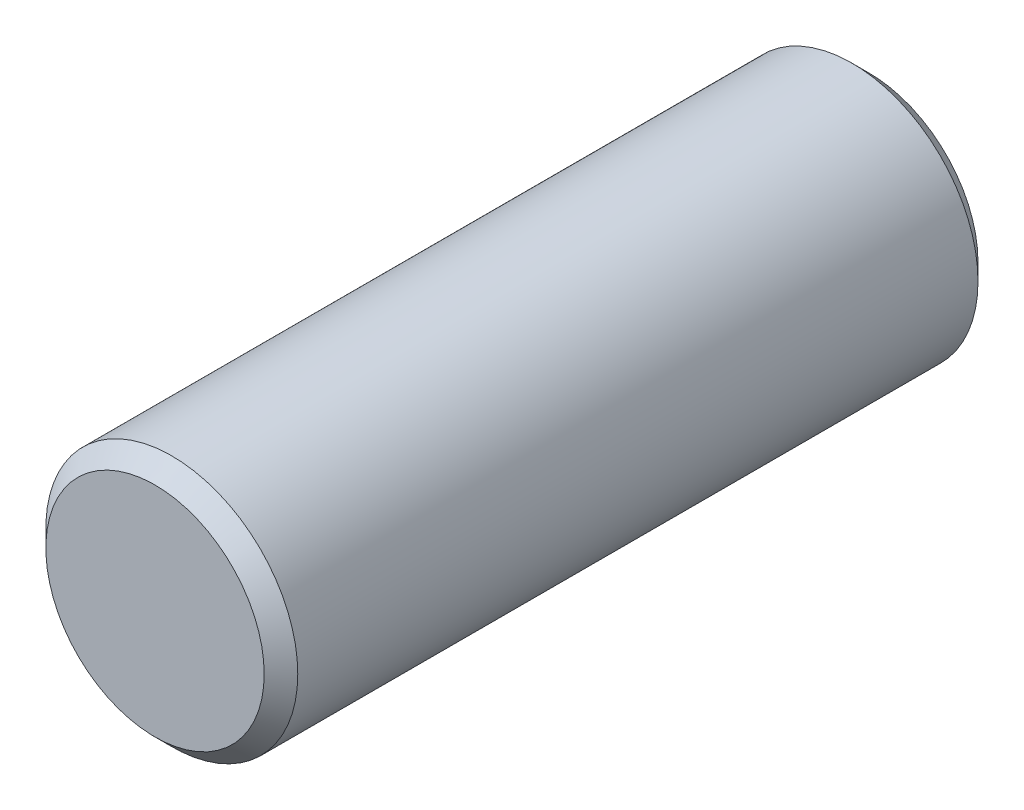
ISO-10303-21;
HEADER;
FILE_DESCRIPTION(('STEP AP214'),'2;1');
FILE_NAME('part.step','',(''),(''),'','','');
FILE_SCHEMA(('AUTOMOTIVE_DESIGN { 1 0 10303 214 1 1 1 1 }'));
ENDSEC;
DATA;
#1=APPLICATION_CONTEXT('core data for automotive mechanical design processes');
#2=APPLICATION_PROTOCOL_DEFINITION('international standard','automotive_design',2000,#1);
#3=PRODUCT_CONTEXT('',#1,'mechanical');
#4=PRODUCT('Part','Part','',(#3));
#5=PRODUCT_RELATED_PRODUCT_CATEGORY('part','',(#4));
#6=PRODUCT_DEFINITION_FORMATION('','',#4);
#7=PRODUCT_DEFINITION_CONTEXT('part definition',#1,'design');
#8=PRODUCT_DEFINITION('design','',#6,#7);
#9=PRODUCT_DEFINITION_SHAPE('','',#8);
#10=(LENGTH_UNIT() NAMED_UNIT(*) SI_UNIT(.MILLI.,.METRE.));
#11=(NAMED_UNIT(*) PLANE_ANGLE_UNIT() SI_UNIT($,.RADIAN.));
#12=(NAMED_UNIT(*) SI_UNIT($,.STERADIAN.) SOLID_ANGLE_UNIT());
#13=UNCERTAINTY_MEASURE_WITH_UNIT(LENGTH_MEASURE(1.E-05),#10,'distance_accuracy_value','');
#14=(GEOMETRIC_REPRESENTATION_CONTEXT(3) GLOBAL_UNCERTAINTY_ASSIGNED_CONTEXT((#13)) GLOBAL_UNIT_ASSIGNED_CONTEXT((#10,
#11,#12)) REPRESENTATION_CONTEXT('',''));
#15=CARTESIAN_POINT('',(0.,0.,0.));
#16=DIRECTION('',(0.,0.,1.));
#17=DIRECTION('',(1.,0.,0.));
#18=AXIS2_PLACEMENT_3D('',#15,#16,#17);
#19=CARTESIAN_POINT('',(0.,0.,85.));
#20=DIRECTION('',(0.,0.,-1.));
#21=DIRECTION('',(-1.,0.,0.));
#22=AXIS2_PLACEMENT_3D('',#19,#20,#21);
#23=CYLINDRICAL_SURFACE('',#22,15.);
#24=CARTESIAN_POINT('',(0.,0.,2.));
#25=DIRECTION('',(0.,0.,1.));
#26=DIRECTION('',(1.,0.,0.));
#27=AXIS2_PLACEMENT_3D('',#24,#25,#26);
#28=CIRCLE('',#27,15.);
#29=CARTESIAN_POINT('',(15.,0.,2.));
#30=VERTEX_POINT('',#29);
#31=EDGE_CURVE('E44',#30,#30,#28,.T.);
#32=ORIENTED_EDGE('',*,*,#31,.T.);
#33=EDGE_LOOP('',(#32));
#34=FACE_BOUND('',#33,.T.);
#35=CARTESIAN_POINT('',(0.,0.,83.));
#36=DIRECTION('',(0.,0.,1.));
#37=DIRECTION('',(1.,0.,0.));
#38=AXIS2_PLACEMENT_3D('',#35,#36,#37);
#39=CIRCLE('',#38,15.);
#40=CARTESIAN_POINT('',(15.,0.,83.));
#41=VERTEX_POINT('',#40);
#42=EDGE_CURVE('E48',#41,#41,#39,.F.);
#43=ORIENTED_EDGE('',*,*,#42,.T.);
#44=EDGE_LOOP('',(#43));
#45=FACE_BOUND('',#44,.T.);
#46=ADVANCED_FACE('F33',(#34,#45),#23,.T.);
#47=CARTESIAN_POINT('',(0.,0.,85.));
#48=DIRECTION('',(0.,0.,1.));
#49=DIRECTION('',(1.,0.,0.));
#50=AXIS2_PLACEMENT_3D('',#47,#48,#49);
#51=PLANE('',#50);
#52=CARTESIAN_POINT('',(0.,0.,85.));
#53=DIRECTION('',(0.,0.,1.));
#54=DIRECTION('',(1.,0.,0.));
#55=AXIS2_PLACEMENT_3D('',#52,#53,#54);
#56=CIRCLE('',#55,13.);
#57=CARTESIAN_POINT('',(13.,0.,85.));
#58=VERTEX_POINT('',#57);
#59=EDGE_CURVE('E10',#58,#58,#56,.T.);
#60=ORIENTED_EDGE('',*,*,#59,.T.);
#61=EDGE_LOOP('',(#60));
#62=FACE_BOUND('',#61,.T.);
#63=ADVANCED_FACE('F64',(#62),#51,.T.);
#64=CARTESIAN_POINT('',(0.,0.,0.));
#65=DIRECTION('',(0.,0.,1.));
#66=DIRECTION('',(1.,0.,0.));
#67=AXIS2_PLACEMENT_3D('',#64,#65,#66);
#68=PLANE('',#67);
#69=CARTESIAN_POINT('',(0.,0.,0.));
#70=DIRECTION('',(0.,0.,1.));
#71=DIRECTION('',(1.,0.,0.));
#72=AXIS2_PLACEMENT_3D('',#69,#70,#71);
#73=CIRCLE('',#72,13.);
#74=CARTESIAN_POINT('',(13.,0.,0.));
#75=VERTEX_POINT('',#74);
#76=EDGE_CURVE('E40',#75,#75,#73,.F.);
#77=ORIENTED_EDGE('',*,*,#76,.T.);
#78=EDGE_LOOP('',(#77));
#79=FACE_BOUND('',#78,.T.);
#80=ADVANCED_FACE('F61',(#79),#68,.F.);
#81=CARTESIAN_POINT('',(0.,0.,2.));
#82=DIRECTION('',(0.,0.,1.));
#83=DIRECTION('',(1.,0.,0.));
#84=AXIS2_PLACEMENT_3D('',#81,#82,#83);
#85=CONICAL_SURFACE('',#84,15.,0.785398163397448);
#86=ORIENTED_EDGE('',*,*,#76,.F.);
#87=EDGE_LOOP('',(#86));
#88=FACE_BOUND('',#87,.T.);
#89=ORIENTED_EDGE('',*,*,#31,.F.);
#90=EDGE_LOOP('',(#89));
#91=FACE_BOUND('',#90,.T.);
#92=ADVANCED_FACE('F57',(#88,#91),#85,.T.);
#93=CARTESIAN_POINT('',(0.,0.,85.));
#94=DIRECTION('',(0.,0.,-1.));
#95=DIRECTION('',(-1.,0.,0.));
#96=AXIS2_PLACEMENT_3D('',#93,#94,#95);
#97=CONICAL_SURFACE('',#96,13.,0.785398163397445);
#98=ORIENTED_EDGE('',*,*,#42,.F.);
#99=EDGE_LOOP('',(#98));
#100=FACE_BOUND('',#99,.T.);
#101=ORIENTED_EDGE('',*,*,#59,.F.);
#102=EDGE_LOOP('',(#101));
#103=FACE_BOUND('',#102,.T.);
#104=ADVANCED_FACE('F35',(#100,#103),#97,.T.);
#105=CLOSED_SHELL('',(#46,#63,#80,#92,#104));
#106=MANIFOLD_SOLID_BREP('B2',#105);
#107=ADVANCED_BREP_SHAPE_REPRESENTATION('',(#18,#106),#14);
#108=SHAPE_DEFINITION_REPRESENTATION(#9,#107);
ENDSEC;
END-ISO-10303-21;
